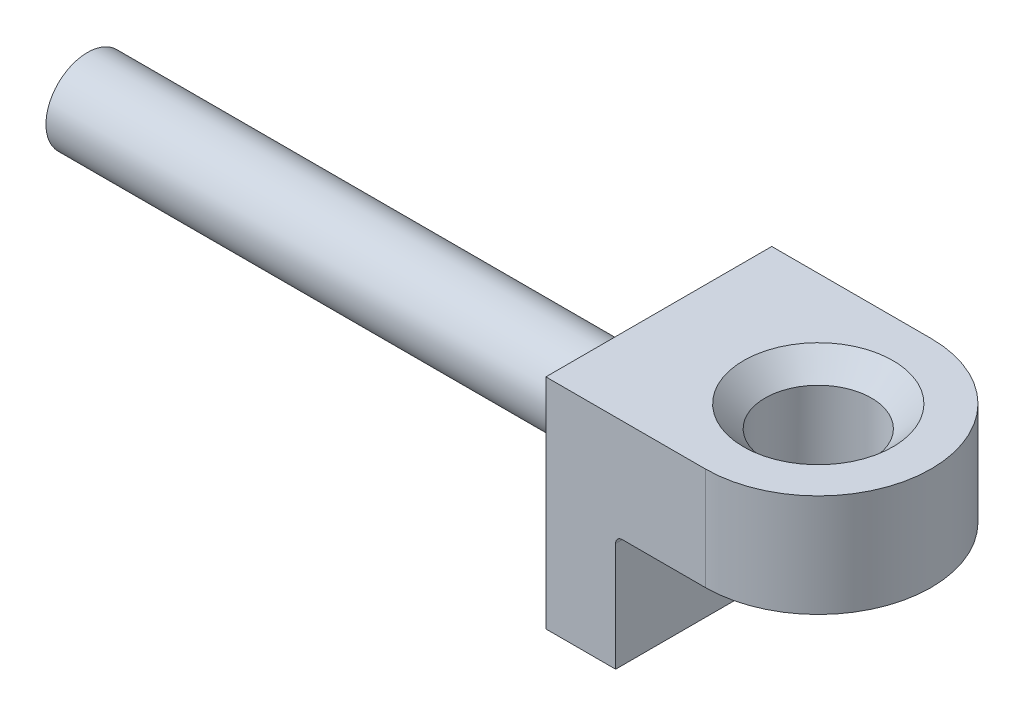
from build123d import *

# Parameters (mm, degrees)
SKETCH1_R                = 1.5875
BOSS_EXTRUDE1_DEPTH      = 21.844
BOSS_EXTRUDE2_DEPTH      = 3.92684
BOSS_EXTRUDE2_DEPTH_BACK = 4.4196
SKETCH2_R                = 2.032
CUT_EXTRUDE1_DEPTH       = 23.701064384
CUT_EXTRUDE1_DEPTH_BACK  = 23.701064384
SKETCH3_W                = 7.747
SKETCH3_H                = 4.4196
FILLET1_R                = 0.0508
FILLET2_R                = 0.254
CHAMFER1_SIZE            = 0.8255


with BuildPart() as part:
    # Sketch1 → Boss-Extrude1 (new body)
    with BuildSketch(Plane(origin=(0, 0, 0), x_dir=(0, 0, -1), z_dir=(1, 0, 0))):
        Circle(SKETCH1_R)
    extrude(amount=-BOSS_EXTRUDE1_DEPTH)

    # Sketch2 → Boss-Extrude2 (add, two sides: drawn at the far end of the back side and taken through both)
    with BuildSketch(Plane(origin=(0, 0, 0), x_dir=(1, 0, 0), z_dir=(0, 1, 0)).offset(-BOSS_EXTRUDE2_DEPTH_BACK)):
        with BuildLine():
            Line((6.096, 4.318), (0, 4.318))
            Line((0, 4.318), (0, -4.318))
            Line((0, -4.318), (6.096, -4.318))
            ThreePointArc((6.096, -4.318), (10.414, 0), (6.096, 4.318))
        make_face()
        with Locations(Location((6.096, 0, 0), (0, 0, 270))):
            Circle(SKETCH2_R, mode=Mode.SUBTRACT)
    extrude(amount=BOSS_EXTRUDE2_DEPTH + BOSS_EXTRUDE2_DEPTH_BACK)

    # Sketch3 → Cut-Extrude1 (cut, two sides: drawn at the far end of the back side and taken through both)
    with BuildSketch(Plane.XY.offset(-CUT_EXTRUDE1_DEPTH_BACK)):
        with Locations((6.5405, -2.2098)):
            Rectangle(SKETCH3_W, SKETCH3_H)
    extrude(amount=CUT_EXTRUDE1_DEPTH + CUT_EXTRUDE1_DEPTH_BACK, mode=Mode.SUBTRACT)

    # Fillet1
    fillet1_edges = [part.edges().sort_by_distance(p)[0] for p in [
        (0, 0, 1.5875),
    ]]
    fillet(fillet1_edges, radius=FILLET1_R)

    # Fillet2
    fillet2_edges = [part.edges().sort_by_distance(p)[0] for p in [
        (2.667, 0, 0),
    ]]
    fillet(fillet2_edges, radius=FILLET2_R)

    # Chamfer1
    chamfer1_edges = [part.edges().sort_by_distance(p)[0] for p in [
        (6.096, 3.92684, -2.032),
    ]]
    chamfer(chamfer1_edges, length=CHAMFER1_SIZE)


solid = part.part
